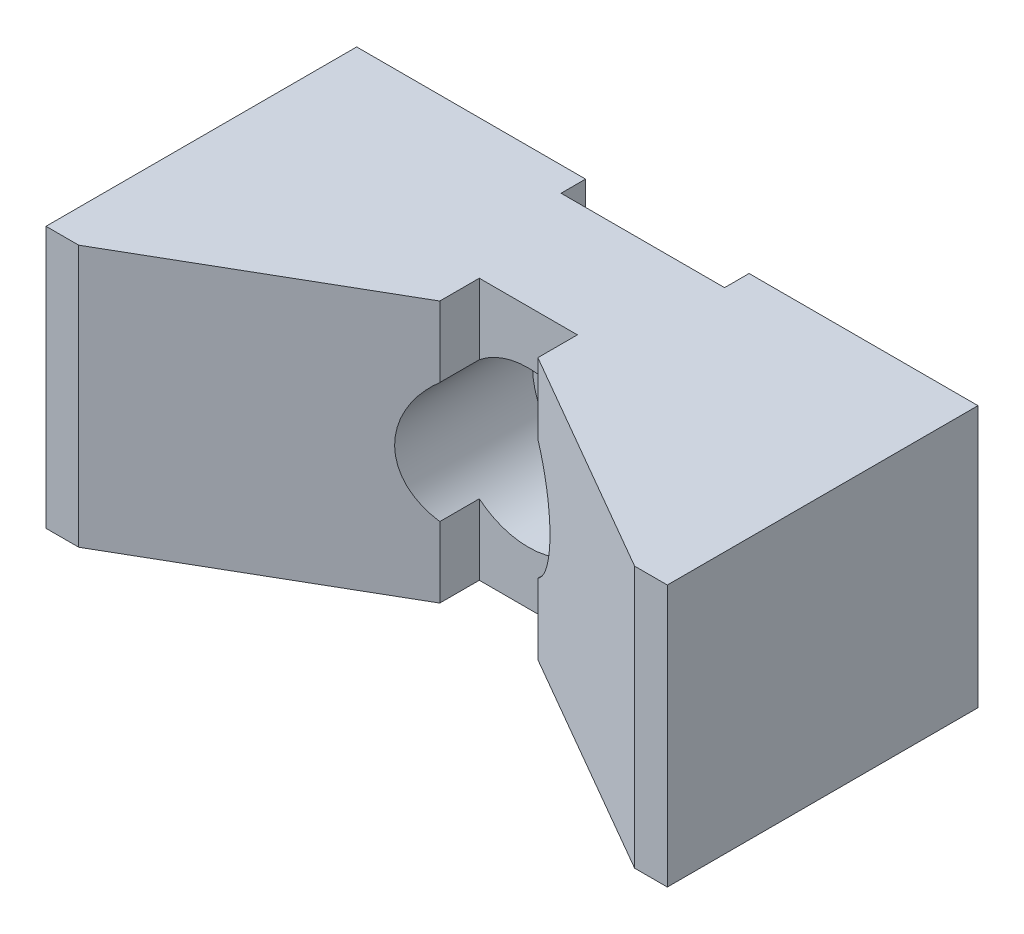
ISO-10303-21;
HEADER;
FILE_DESCRIPTION(('STEP AP214'),'2;1');
FILE_NAME('part.step','',(''),(''),'','','');
FILE_SCHEMA(('AUTOMOTIVE_DESIGN { 1 0 10303 214 1 1 1 1 }'));
ENDSEC;
DATA;
#1=APPLICATION_CONTEXT('core data for automotive mechanical design processes');
#2=APPLICATION_PROTOCOL_DEFINITION('international standard','automotive_design',2000,#1);
#3=PRODUCT_CONTEXT('',#1,'mechanical');
#4=PRODUCT('Part','Part','',(#3));
#5=PRODUCT_RELATED_PRODUCT_CATEGORY('part','',(#4));
#6=PRODUCT_DEFINITION_FORMATION('','',#4);
#7=PRODUCT_DEFINITION_CONTEXT('part definition',#1,'design');
#8=PRODUCT_DEFINITION('design','',#6,#7);
#9=PRODUCT_DEFINITION_SHAPE('','',#8);
#10=(LENGTH_UNIT() NAMED_UNIT(*) SI_UNIT(.MILLI.,.METRE.));
#11=(NAMED_UNIT(*) PLANE_ANGLE_UNIT() SI_UNIT($,.RADIAN.));
#12=(NAMED_UNIT(*) SI_UNIT($,.STERADIAN.) SOLID_ANGLE_UNIT());
#13=UNCERTAINTY_MEASURE_WITH_UNIT(LENGTH_MEASURE(1.E-05),#10,'distance_accuracy_value','');
#14=(GEOMETRIC_REPRESENTATION_CONTEXT(3) GLOBAL_UNCERTAINTY_ASSIGNED_CONTEXT((#13)) GLOBAL_UNIT_ASSIGNED_CONTEXT((#10,
#11,#12)) REPRESENTATION_CONTEXT('',''));
#15=CARTESIAN_POINT('',(0.,0.,0.));
#16=DIRECTION('',(0.,0.,1.));
#17=DIRECTION('',(1.,0.,0.));
#18=AXIS2_PLACEMENT_3D('',#15,#16,#17);
#19=CARTESIAN_POINT('',(19.,8.,0.));
#20=DIRECTION('',(0.,0.,1.));
#21=DIRECTION('',(1.,0.,0.));
#22=AXIS2_PLACEMENT_3D('',#19,#20,#21);
#23=PLANE('',#22);
#24=DIRECTION('',(-1.,0.,0.));
#25=VECTOR('',#24,1.);
#26=CARTESIAN_POINT('',(19.,8.,0.));
#27=LINE('',#26,#25);
#28=CARTESIAN_POINT('',(-5.,8.,0.));
#29=VERTEX_POINT('',#28);
#30=CARTESIAN_POINT('',(-19.,8.,0.));
#31=VERTEX_POINT('',#30);
#32=EDGE_CURVE('E238',#29,#31,#27,.T.);
#33=ORIENTED_EDGE('',*,*,#32,.F.);
#34=DIRECTION('',(0.,1.,0.));
#35=VECTOR('',#34,1.);
#36=CARTESIAN_POINT('',(-5.,-29.5,0.));
#37=LINE('',#36,#35);
#38=CARTESIAN_POINT('',(-5.,-8.,0.));
#39=VERTEX_POINT('',#38);
#40=EDGE_CURVE('E189',#39,#29,#37,.T.);
#41=ORIENTED_EDGE('',*,*,#40,.F.);
#42=DIRECTION('',(-1.,0.,0.));
#43=VECTOR('',#42,1.);
#44=CARTESIAN_POINT('',(19.,-8.,0.));
#45=LINE('',#44,#43);
#46=CARTESIAN_POINT('',(-19.,-8.,0.));
#47=VERTEX_POINT('',#46);
#48=EDGE_CURVE('E222',#39,#47,#45,.T.);
#49=ORIENTED_EDGE('',*,*,#48,.T.);
#50=DIRECTION('',(0.,-1.,0.));
#51=VECTOR('',#50,1.);
#52=CARTESIAN_POINT('',(-19.,8.,0.));
#53=LINE('',#52,#51);
#54=EDGE_CURVE('E242',#31,#47,#53,.T.);
#55=ORIENTED_EDGE('',*,*,#54,.F.);
#56=EDGE_LOOP('',(#33,#41,#49,#55));
#57=FACE_BOUND('',#56,.T.);
#58=ADVANCED_FACE('F14',(#57),#23,.F.);
#59=CARTESIAN_POINT('',(-19.,8.,0.));
#60=DIRECTION('',(1.,0.,0.));
#61=DIRECTION('',(0.,0.,-1.));
#62=AXIS2_PLACEMENT_3D('',#59,#60,#61);
#63=PLANE('',#62);
#64=DIRECTION('',(0.,0.,1.));
#65=VECTOR('',#64,1.);
#66=CARTESIAN_POINT('',(-19.,-8.,0.));
#67=LINE('',#66,#65);
#68=CARTESIAN_POINT('',(-19.,-8.,19.));
#69=VERTEX_POINT('',#68);
#70=EDGE_CURVE('E208',#47,#69,#67,.T.);
#71=ORIENTED_EDGE('',*,*,#70,.T.);
#72=DIRECTION('',(0.,-1.,0.));
#73=VECTOR('',#72,1.);
#74=CARTESIAN_POINT('',(-19.,8.,19.));
#75=LINE('',#74,#73);
#76=CARTESIAN_POINT('',(-19.,8.,19.));
#77=VERTEX_POINT('',#76);
#78=EDGE_CURVE('E257',#77,#69,#75,.T.);
#79=ORIENTED_EDGE('',*,*,#78,.F.);
#80=DIRECTION('',(0.,0.,1.));
#81=VECTOR('',#80,1.);
#82=CARTESIAN_POINT('',(-19.,8.,0.));
#83=LINE('',#82,#81);
#84=EDGE_CURVE('E226',#31,#77,#83,.T.);
#85=ORIENTED_EDGE('',*,*,#84,.F.);
#86=ORIENTED_EDGE('',*,*,#54,.T.);
#87=EDGE_LOOP('',(#71,#79,#85,#86));
#88=FACE_BOUND('',#87,.T.);
#89=ADVANCED_FACE('F16',(#88),#63,.F.);
#90=CARTESIAN_POINT('',(-19.,8.,19.));
#91=DIRECTION('',(0.,0.,-1.));
#92=DIRECTION('',(-1.,0.,0.));
#93=AXIS2_PLACEMENT_3D('',#90,#91,#92);
#94=PLANE('',#93);
#95=DIRECTION('',(1.,0.,0.));
#96=VECTOR('',#95,1.);
#97=CARTESIAN_POINT('',(-19.,-8.,19.));
#98=LINE('',#97,#96);
#99=CARTESIAN_POINT('',(-17.,-8.,19.));
#100=VERTEX_POINT('',#99);
#101=EDGE_CURVE('E211',#69,#100,#98,.T.);
#102=ORIENTED_EDGE('',*,*,#101,.T.);
#103=DIRECTION('',(0.,-1.,0.));
#104=VECTOR('',#103,1.);
#105=CARTESIAN_POINT('',(-17.,8.,19.));
#106=LINE('',#105,#104);
#107=CARTESIAN_POINT('',(-17.,8.,19.));
#108=VERTEX_POINT('',#107);
#109=EDGE_CURVE('E254',#108,#100,#106,.T.);
#110=ORIENTED_EDGE('',*,*,#109,.F.);
#111=DIRECTION('',(1.,0.,0.));
#112=VECTOR('',#111,1.);
#113=CARTESIAN_POINT('',(-19.,8.,19.));
#114=LINE('',#113,#112);
#115=EDGE_CURVE('E229',#77,#108,#114,.T.);
#116=ORIENTED_EDGE('',*,*,#115,.F.);
#117=ORIENTED_EDGE('',*,*,#78,.T.);
#118=EDGE_LOOP('',(#102,#110,#116,#117));
#119=FACE_BOUND('',#118,.T.);
#120=ADVANCED_FACE('F330',(#119),#94,.F.);
#121=CARTESIAN_POINT('',(-17.,8.,19.));
#122=DIRECTION('',(-0.5,0.,-0.86602540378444));
#123=DIRECTION('',(-0.86602540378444,0.,0.5));
#124=AXIS2_PLACEMENT_3D('',#121,#122,#123);
#125=PLANE('',#124);
#126=DIRECTION('',(0.86602540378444,0.,-0.5));
#127=VECTOR('',#126,1.);
#128=CARTESIAN_POINT('',(-17.,-8.,19.));
#129=LINE('',#128,#127);
#130=CARTESIAN_POINT('',(-3.,-8.,10.9170962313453));
#131=VERTEX_POINT('',#130);
#132=EDGE_CURVE('E213',#100,#131,#129,.T.);
#133=ORIENTED_EDGE('',*,*,#132,.T.);
#134=DIRECTION('',(0.,1.,0.));
#135=VECTOR('',#134,1.);
#136=CARTESIAN_POINT('',(-3.,8.,10.9170962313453));
#137=LINE('',#136,#135);
#138=CARTESIAN_POINT('',(-3.,-3.68272996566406,10.9170962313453));
#139=VERTEX_POINT('',#138);
#140=EDGE_CURVE('E165',#131,#139,#137,.T.);
#141=ORIENTED_EDGE('',*,*,#140,.T.);
#142=CARTESIAN_POINT('',(0.,0.,9.18504542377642));
#143=DIRECTION('',(-0.5,0.,-0.86602540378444));
#144=DIRECTION('',(0.86602540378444,0.,-0.5));
#145=AXIS2_PLACEMENT_3D('',#142,#143,#144);
#146=ELLIPSE('',#145,5.48482755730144,4.75);
#147=CARTESIAN_POINT('',(-3.,3.68272996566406,10.9170962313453));
#148=VERTEX_POINT('',#147);
#149=EDGE_CURVE('E185',#139,#148,#146,.T.);
#150=ORIENTED_EDGE('',*,*,#149,.T.);
#151=CARTESIAN_POINT('',(-3.,8.,10.9170962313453));
#152=VERTEX_POINT('',#151);
#153=EDGE_CURVE('E37',#148,#152,#137,.T.);
#154=ORIENTED_EDGE('',*,*,#153,.T.);
#155=DIRECTION('',(0.86602540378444,0.,-0.5));
#156=VECTOR('',#155,1.);
#157=CARTESIAN_POINT('',(-17.,8.,19.));
#158=LINE('',#157,#156);
#159=EDGE_CURVE('E159',#108,#152,#158,.T.);
#160=ORIENTED_EDGE('',*,*,#159,.F.);
#161=ORIENTED_EDGE('',*,*,#109,.T.);
#162=EDGE_LOOP('',(#133,#141,#150,#154,#160,#161));
#163=FACE_BOUND('',#162,.T.);
#164=ADVANCED_FACE('F333',(#163),#125,.F.);
#165=CARTESIAN_POINT('',(17.,8.,19.));
#166=DIRECTION('',(0.5,0.,-0.86602540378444));
#167=DIRECTION('',(-0.86602540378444,0.,-0.5));
#168=AXIS2_PLACEMENT_3D('',#165,#166,#167);
#169=PLANE('',#168);
#170=DIRECTION('',(0.86602540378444,0.,0.5));
#171=VECTOR('',#170,1.);
#172=CARTESIAN_POINT('',(17.,8.,19.));
#173=LINE('',#172,#171);
#174=CARTESIAN_POINT('',(3.,8.,10.9170962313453));
#175=VERTEX_POINT('',#174);
#176=CARTESIAN_POINT('',(17.,8.,19.));
#177=VERTEX_POINT('',#176);
#178=EDGE_CURVE('E232',#175,#177,#173,.T.);
#179=ORIENTED_EDGE('',*,*,#178,.F.);
#180=DIRECTION('',(0.,-1.,0.));
#181=VECTOR('',#180,1.);
#182=CARTESIAN_POINT('',(3.,8.,10.9170962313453));
#183=LINE('',#182,#181);
#184=CARTESIAN_POINT('',(3.,3.68272996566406,10.9170962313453));
#185=VERTEX_POINT('',#184);
#186=EDGE_CURVE('E170',#175,#185,#183,.T.);
#187=ORIENTED_EDGE('',*,*,#186,.T.);
#188=CARTESIAN_POINT('',(0.,0.,9.18504542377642));
#189=DIRECTION('',(0.5,0.,-0.86602540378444));
#190=DIRECTION('',(-0.86602540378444,0.,-0.5));
#191=AXIS2_PLACEMENT_3D('',#188,#189,#190);
#192=ELLIPSE('',#191,5.48482755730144,4.75);
#193=CARTESIAN_POINT('',(3.,-3.68272996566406,10.9170962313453));
#194=VERTEX_POINT('',#193);
#195=EDGE_CURVE('E267',#185,#194,#192,.T.);
#196=ORIENTED_EDGE('',*,*,#195,.T.);
#197=CARTESIAN_POINT('',(3.,-8.,10.9170962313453));
#198=VERTEX_POINT('',#197);
#199=EDGE_CURVE('E173',#194,#198,#183,.T.);
#200=ORIENTED_EDGE('',*,*,#199,.T.);
#201=DIRECTION('',(0.86602540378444,0.,0.5));
#202=VECTOR('',#201,1.);
#203=CARTESIAN_POINT('',(17.,-8.,19.));
#204=LINE('',#203,#202);
#205=CARTESIAN_POINT('',(17.,-8.,19.));
#206=VERTEX_POINT('',#205);
#207=EDGE_CURVE('E216',#198,#206,#204,.T.);
#208=ORIENTED_EDGE('',*,*,#207,.T.);
#209=DIRECTION('',(0.,-1.,0.));
#210=VECTOR('',#209,1.);
#211=CARTESIAN_POINT('',(17.,8.,19.));
#212=LINE('',#211,#210);
#213=EDGE_CURVE('E251',#177,#206,#212,.T.);
#214=ORIENTED_EDGE('',*,*,#213,.F.);
#215=EDGE_LOOP('',(#179,#187,#196,#200,#208,#214));
#216=FACE_BOUND('',#215,.T.);
#217=ADVANCED_FACE('F289',(#216),#169,.F.);
#218=CARTESIAN_POINT('',(19.,8.,19.));
#219=DIRECTION('',(0.,0.,-1.));
#220=DIRECTION('',(-1.,0.,0.));
#221=AXIS2_PLACEMENT_3D('',#218,#219,#220);
#222=PLANE('',#221);
#223=DIRECTION('',(1.,0.,0.));
#224=VECTOR('',#223,1.);
#225=CARTESIAN_POINT('',(19.,-8.,19.));
#226=LINE('',#225,#224);
#227=CARTESIAN_POINT('',(19.,-8.,19.));
#228=VERTEX_POINT('',#227);
#229=EDGE_CURVE('E218',#206,#228,#226,.T.);
#230=ORIENTED_EDGE('',*,*,#229,.T.);
#231=DIRECTION('',(0.,-1.,0.));
#232=VECTOR('',#231,1.);
#233=CARTESIAN_POINT('',(19.,8.,19.));
#234=LINE('',#233,#232);
#235=CARTESIAN_POINT('',(19.,8.,19.));
#236=VERTEX_POINT('',#235);
#237=EDGE_CURVE('E248',#236,#228,#234,.T.);
#238=ORIENTED_EDGE('',*,*,#237,.F.);
#239=DIRECTION('',(1.,0.,0.));
#240=VECTOR('',#239,1.);
#241=CARTESIAN_POINT('',(19.,8.,19.));
#242=LINE('',#241,#240);
#243=EDGE_CURVE('E234',#177,#236,#242,.T.);
#244=ORIENTED_EDGE('',*,*,#243,.F.);
#245=ORIENTED_EDGE('',*,*,#213,.T.);
#246=EDGE_LOOP('',(#230,#238,#244,#245));
#247=FACE_BOUND('',#246,.T.);
#248=ADVANCED_FACE('F296',(#247),#222,.F.);
#249=CARTESIAN_POINT('',(19.,8.,0.));
#250=DIRECTION('',(-1.,0.,0.));
#251=DIRECTION('',(0.,0.,1.));
#252=AXIS2_PLACEMENT_3D('',#249,#250,#251);
#253=PLANE('',#252);
#254=DIRECTION('',(0.,0.,-1.));
#255=VECTOR('',#254,1.);
#256=CARTESIAN_POINT('',(19.,-8.,0.));
#257=LINE('',#256,#255);
#258=CARTESIAN_POINT('',(19.,-8.,0.));
#259=VERTEX_POINT('',#258);
#260=EDGE_CURVE('E220',#228,#259,#257,.T.);
#261=ORIENTED_EDGE('',*,*,#260,.T.);
#262=DIRECTION('',(0.,-1.,0.));
#263=VECTOR('',#262,1.);
#264=CARTESIAN_POINT('',(19.,8.,0.));
#265=LINE('',#264,#263);
#266=CARTESIAN_POINT('',(19.,8.,0.));
#267=VERTEX_POINT('',#266);
#268=EDGE_CURVE('E245',#267,#259,#265,.T.);
#269=ORIENTED_EDGE('',*,*,#268,.F.);
#270=DIRECTION('',(0.,0.,-1.));
#271=VECTOR('',#270,1.);
#272=CARTESIAN_POINT('',(19.,8.,0.));
#273=LINE('',#272,#271);
#274=EDGE_CURVE('E236',#236,#267,#273,.T.);
#275=ORIENTED_EDGE('',*,*,#274,.F.);
#276=ORIENTED_EDGE('',*,*,#237,.T.);
#277=EDGE_LOOP('',(#261,#269,#275,#276));
#278=FACE_BOUND('',#277,.T.);
#279=ADVANCED_FACE('F301',(#278),#253,.F.);
#280=CARTESIAN_POINT('',(5.,-8.,0.));
#281=VERTEX_POINT('',#280);
#282=EDGE_CURVE('E223',#259,#281,#45,.T.);
#283=ORIENTED_EDGE('',*,*,#282,.T.);
#284=DIRECTION('',(0.,1.,0.));
#285=VECTOR('',#284,1.);
#286=CARTESIAN_POINT('',(5.,-29.5,0.));
#287=LINE('',#286,#285);
#288=CARTESIAN_POINT('',(5.,8.,0.));
#289=VERTEX_POINT('',#288);
#290=EDGE_CURVE('E192',#281,#289,#287,.T.);
#291=ORIENTED_EDGE('',*,*,#290,.T.);
#292=EDGE_CURVE('E239',#267,#289,#27,.T.);
#293=ORIENTED_EDGE('',*,*,#292,.F.);
#294=ORIENTED_EDGE('',*,*,#268,.T.);
#295=EDGE_LOOP('',(#283,#291,#293,#294));
#296=FACE_BOUND('',#295,.T.);
#297=ADVANCED_FACE('F305',(#296),#23,.F.);
#298=CARTESIAN_POINT('',(-19.,8.,0.));
#299=DIRECTION('',(0.,-1.,0.));
#300=DIRECTION('',(-1.,0.,0.));
#301=AXIS2_PLACEMENT_3D('',#298,#299,#300);
#302=PLANE('',#301);
#303=DIRECTION('',(-1.,0.,0.));
#304=VECTOR('',#303,1.);
#305=CARTESIAN_POINT('',(-3.,8.,8.5));
#306=LINE('',#305,#304);
#307=CARTESIAN_POINT('',(3.,8.,8.5));
#308=VERTEX_POINT('',#307);
#309=CARTESIAN_POINT('',(-3.,8.,8.5));
#310=VERTEX_POINT('',#309);
#311=EDGE_CURVE('E148',#308,#310,#306,.T.);
#312=ORIENTED_EDGE('',*,*,#311,.F.);
#313=DIRECTION('',(0.,0.,-1.));
#314=VECTOR('',#313,1.);
#315=CARTESIAN_POINT('',(3.,8.,8.5));
#316=LINE('',#315,#314);
#317=EDGE_CURVE('E145',#175,#308,#316,.T.);
#318=ORIENTED_EDGE('',*,*,#317,.F.);
#319=ORIENTED_EDGE('',*,*,#178,.T.);
#320=ORIENTED_EDGE('',*,*,#243,.T.);
#321=ORIENTED_EDGE('',*,*,#274,.T.);
#322=ORIENTED_EDGE('',*,*,#292,.T.);
#323=DIRECTION('',(0.,0.,1.));
#324=VECTOR('',#323,1.);
#325=CARTESIAN_POINT('',(5.,8.,0.));
#326=LINE('',#325,#324);
#327=CARTESIAN_POINT('',(5.,8.,1.5));
#328=VERTEX_POINT('',#327);
#329=EDGE_CURVE('E202',#289,#328,#326,.T.);
#330=ORIENTED_EDGE('',*,*,#329,.T.);
#331=DIRECTION('',(-1.,0.,0.));
#332=VECTOR('',#331,1.);
#333=CARTESIAN_POINT('',(-19.,8.,1.5));
#334=LINE('',#333,#332);
#335=CARTESIAN_POINT('',(-5.,8.,1.5));
#336=VERTEX_POINT('',#335);
#337=EDGE_CURVE('E191',#328,#336,#334,.T.);
#338=ORIENTED_EDGE('',*,*,#337,.T.);
#339=DIRECTION('',(0.,0.,-1.));
#340=VECTOR('',#339,1.);
#341=CARTESIAN_POINT('',(-5.,8.,0.));
#342=LINE('',#341,#340);
#343=EDGE_CURVE('E205',#336,#29,#342,.T.);
#344=ORIENTED_EDGE('',*,*,#343,.T.);
#345=ORIENTED_EDGE('',*,*,#32,.T.);
#346=ORIENTED_EDGE('',*,*,#84,.T.);
#347=ORIENTED_EDGE('',*,*,#115,.T.);
#348=ORIENTED_EDGE('',*,*,#159,.T.);
#349=DIRECTION('',(0.,0.,1.));
#350=VECTOR('',#349,1.);
#351=CARTESIAN_POINT('',(-3.,8.,8.5));
#352=LINE('',#351,#350);
#353=EDGE_CURVE('E141',#310,#152,#352,.T.);
#354=ORIENTED_EDGE('',*,*,#353,.F.);
#355=EDGE_LOOP('',(#312,#318,#319,#320,#321,#322,#330,#338,#344,#345,#346,#347,#348,#354));
#356=FACE_BOUND('',#355,.T.);
#357=ADVANCED_FACE('F157',(#356),#302,.F.);
#358=CARTESIAN_POINT('',(-19.,-8.,0.));
#359=DIRECTION('',(0.,-1.,0.));
#360=DIRECTION('',(-1.,0.,0.));
#361=AXIS2_PLACEMENT_3D('',#358,#359,#360);
#362=PLANE('',#361);
#363=DIRECTION('',(0.,0.,1.));
#364=VECTOR('',#363,1.);
#365=CARTESIAN_POINT('',(3.,-8.,0.));
#366=LINE('',#365,#364);
#367=CARTESIAN_POINT('',(3.,-8.,8.5));
#368=VERTEX_POINT('',#367);
#369=EDGE_CURVE('E174',#368,#198,#366,.T.);
#370=ORIENTED_EDGE('',*,*,#369,.F.);
#371=DIRECTION('',(1.,0.,0.));
#372=VECTOR('',#371,1.);
#373=CARTESIAN_POINT('',(-19.,-8.,8.5));
#374=LINE('',#373,#372);
#375=CARTESIAN_POINT('',(-3.,-8.,8.5));
#376=VERTEX_POINT('',#375);
#377=EDGE_CURVE('E176',#376,#368,#374,.T.);
#378=ORIENTED_EDGE('',*,*,#377,.F.);
#379=DIRECTION('',(0.,0.,-1.));
#380=VECTOR('',#379,1.);
#381=CARTESIAN_POINT('',(-3.,-8.,0.));
#382=LINE('',#381,#380);
#383=EDGE_CURVE('E168',#131,#376,#382,.T.);
#384=ORIENTED_EDGE('',*,*,#383,.F.);
#385=ORIENTED_EDGE('',*,*,#132,.F.);
#386=ORIENTED_EDGE('',*,*,#101,.F.);
#387=ORIENTED_EDGE('',*,*,#70,.F.);
#388=ORIENTED_EDGE('',*,*,#48,.F.);
#389=DIRECTION('',(0.,0.,-1.));
#390=VECTOR('',#389,1.);
#391=CARTESIAN_POINT('',(-5.,-8.,0.));
#392=LINE('',#391,#390);
#393=CARTESIAN_POINT('',(-5.,-8.,1.5));
#394=VERTEX_POINT('',#393);
#395=EDGE_CURVE('E265',#394,#39,#392,.T.);
#396=ORIENTED_EDGE('',*,*,#395,.F.);
#397=DIRECTION('',(-1.,0.,0.));
#398=VECTOR('',#397,1.);
#399=CARTESIAN_POINT('',(-19.,-8.,1.5));
#400=LINE('',#399,#398);
#401=CARTESIAN_POINT('',(5.,-8.,1.5));
#402=VERTEX_POINT('',#401);
#403=EDGE_CURVE('E260',#402,#394,#400,.T.);
#404=ORIENTED_EDGE('',*,*,#403,.F.);
#405=DIRECTION('',(0.,0.,1.));
#406=VECTOR('',#405,1.);
#407=CARTESIAN_POINT('',(5.,-8.,0.));
#408=LINE('',#407,#406);
#409=EDGE_CURVE('E262',#281,#402,#408,.T.);
#410=ORIENTED_EDGE('',*,*,#409,.F.);
#411=ORIENTED_EDGE('',*,*,#282,.F.);
#412=ORIENTED_EDGE('',*,*,#260,.F.);
#413=ORIENTED_EDGE('',*,*,#229,.F.);
#414=ORIENTED_EDGE('',*,*,#207,.F.);
#415=EDGE_LOOP('',(#370,#378,#384,#385,#386,#387,#388,#396,#404,#410,#411,#412,#413,#414));
#416=FACE_BOUND('',#415,.T.);
#417=ADVANCED_FACE('F312',(#416),#362,.T.);
#418=CARTESIAN_POINT('',(-5.,-29.5,0.));
#419=DIRECTION('',(-1.,0.,0.));
#420=DIRECTION('',(0.,0.,1.));
#421=AXIS2_PLACEMENT_3D('',#418,#419,#420);
#422=PLANE('',#421);
#423=DIRECTION('',(0.,1.,0.));
#424=VECTOR('',#423,1.);
#425=CARTESIAN_POINT('',(-5.,-29.5,1.5));
#426=LINE('',#425,#424);
#427=EDGE_CURVE('E188',#394,#336,#426,.T.);
#428=ORIENTED_EDGE('',*,*,#427,.F.);
#429=ORIENTED_EDGE('',*,*,#395,.T.);
#430=ORIENTED_EDGE('',*,*,#40,.T.);
#431=ORIENTED_EDGE('',*,*,#343,.F.);
#432=EDGE_LOOP('',(#428,#429,#430,#431));
#433=FACE_BOUND('',#432,.T.);
#434=ADVANCED_FACE('F319',(#433),#422,.F.);
#435=CARTESIAN_POINT('',(5.,-29.5,0.));
#436=DIRECTION('',(1.,0.,0.));
#437=DIRECTION('',(0.,0.,-1.));
#438=AXIS2_PLACEMENT_3D('',#435,#436,#437);
#439=PLANE('',#438);
#440=ORIENTED_EDGE('',*,*,#290,.F.);
#441=ORIENTED_EDGE('',*,*,#409,.T.);
#442=DIRECTION('',(0.,1.,0.));
#443=VECTOR('',#442,1.);
#444=CARTESIAN_POINT('',(5.,-29.5,1.5));
#445=LINE('',#444,#443);
#446=EDGE_CURVE('E195',#402,#328,#445,.T.);
#447=ORIENTED_EDGE('',*,*,#446,.T.);
#448=ORIENTED_EDGE('',*,*,#329,.F.);
#449=EDGE_LOOP('',(#440,#441,#447,#448));
#450=FACE_BOUND('',#449,.T.);
#451=ADVANCED_FACE('F308',(#450),#439,.F.);
#452=CARTESIAN_POINT('',(-5.,-29.5,1.5));
#453=DIRECTION('',(0.,0.,1.));
#454=DIRECTION('',(1.,0.,0.));
#455=AXIS2_PLACEMENT_3D('',#452,#453,#454);
#456=PLANE('',#455);
#457=CARTESIAN_POINT('',(0.,0.,1.5));
#458=DIRECTION('',(0.,0.,1.));
#459=DIRECTION('',(1.,0.,0.));
#460=AXIS2_PLACEMENT_3D('',#457,#458,#459);
#461=CIRCLE('',#460,2.75);
#462=CARTESIAN_POINT('',(2.75,0.,1.5));
#463=VERTEX_POINT('',#462);
#464=EDGE_CURVE('E179',#463,#463,#461,.T.);
#465=ORIENTED_EDGE('',*,*,#464,.T.);
#466=EDGE_LOOP('',(#465));
#467=FACE_BOUND('',#466,.T.);
#468=ORIENTED_EDGE('',*,*,#446,.F.);
#469=ORIENTED_EDGE('',*,*,#403,.T.);
#470=ORIENTED_EDGE('',*,*,#427,.T.);
#471=ORIENTED_EDGE('',*,*,#337,.F.);
#472=EDGE_LOOP('',(#468,#469,#470,#471));
#473=FACE_BOUND('',#472,.T.);
#474=ADVANCED_FACE('F317',(#467,#473),#456,.F.);
#475=CARTESIAN_POINT('',(0.,0.,19.));
#476=DIRECTION('',(0.,0.,-1.));
#477=DIRECTION('',(-1.,0.,0.));
#478=AXIS2_PLACEMENT_3D('',#475,#476,#477);
#479=CYLINDRICAL_SURFACE('',#478,4.75);
#480=CARTESIAN_POINT('',(0.,0.,3.5));
#481=DIRECTION('',(0.,0.,-1.));
#482=DIRECTION('',(-1.,0.,0.));
#483=AXIS2_PLACEMENT_3D('',#480,#481,#482);
#484=CIRCLE('',#483,4.75);
#485=CARTESIAN_POINT('',(-4.75,0.,3.5));
#486=VERTEX_POINT('',#485);
#487=EDGE_CURVE('E182',#486,#486,#484,.T.);
#488=ORIENTED_EDGE('',*,*,#487,.T.);
#489=EDGE_LOOP('',(#488));
#490=FACE_BOUND('',#489,.T.);
#491=ORIENTED_EDGE('',*,*,#195,.F.);
#492=DIRECTION('',(0.,0.,-1.));
#493=VECTOR('',#492,1.);
#494=CARTESIAN_POINT('',(3.,3.68272996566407,19.));
#495=LINE('',#494,#493);
#496=CARTESIAN_POINT('',(3.,3.68272996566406,8.5));
#497=VERTEX_POINT('',#496);
#498=EDGE_CURVE('E9',#185,#497,#495,.T.);
#499=ORIENTED_EDGE('',*,*,#498,.T.);
#500=CARTESIAN_POINT('',(0.,0.,8.5));
#501=DIRECTION('',(0.,0.,-1.));
#502=DIRECTION('',(-1.,0.,0.));
#503=AXIS2_PLACEMENT_3D('',#500,#501,#502);
#504=CIRCLE('',#503,4.75);
#505=CARTESIAN_POINT('',(-3.,3.68272996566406,8.5));
#506=VERTEX_POINT('',#505);
#507=EDGE_CURVE('E22',#497,#506,#504,.F.);
#508=ORIENTED_EDGE('',*,*,#507,.T.);
#509=DIRECTION('',(0.,0.,-1.));
#510=VECTOR('',#509,1.);
#511=CARTESIAN_POINT('',(-3.,3.68272996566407,19.));
#512=LINE('',#511,#510);
#513=EDGE_CURVE('E142',#506,#148,#512,.F.);
#514=ORIENTED_EDGE('',*,*,#513,.T.);
#515=ORIENTED_EDGE('',*,*,#149,.F.);
#516=DIRECTION('',(0.,0.,-1.));
#517=VECTOR('',#516,1.);
#518=CARTESIAN_POINT('',(-3.,-3.68272996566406,19.));
#519=LINE('',#518,#517);
#520=CARTESIAN_POINT('',(-3.,-3.68272996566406,8.5));
#521=VERTEX_POINT('',#520);
#522=EDGE_CURVE('E270',#139,#521,#519,.T.);
#523=ORIENTED_EDGE('',*,*,#522,.T.);
#524=CARTESIAN_POINT('',(3.,-3.68272996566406,8.5));
#525=VERTEX_POINT('',#524);
#526=EDGE_CURVE('E275',#521,#525,#504,.F.);
#527=ORIENTED_EDGE('',*,*,#526,.T.);
#528=DIRECTION('',(0.,0.,-1.));
#529=VECTOR('',#528,1.);
#530=CARTESIAN_POINT('',(3.,-3.68272996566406,19.));
#531=LINE('',#530,#529);
#532=EDGE_CURVE('E278',#525,#194,#531,.F.);
#533=ORIENTED_EDGE('',*,*,#532,.T.);
#534=EDGE_LOOP('',(#491,#499,#508,#514,#515,#523,#527,#533));
#535=FACE_BOUND('',#534,.T.);
#536=ADVANCED_FACE('F283',(#490,#535),#479,.F.);
#537=CARTESIAN_POINT('',(0.,0.,3.5));
#538=DIRECTION('',(0.,0.,-1.));
#539=DIRECTION('',(-1.,0.,0.));
#540=AXIS2_PLACEMENT_3D('',#537,#538,#539);
#541=PLANE('',#540);
#542=CARTESIAN_POINT('',(0.,0.,3.5));
#543=DIRECTION('',(0.,0.,-1.));
#544=DIRECTION('',(-1.,0.,0.));
#545=AXIS2_PLACEMENT_3D('',#542,#543,#544);
#546=CIRCLE('',#545,2.75);
#547=CARTESIAN_POINT('',(-2.75,0.,3.5));
#548=VERTEX_POINT('',#547);
#549=EDGE_CURVE('E178',#548,#548,#546,.T.);
#550=ORIENTED_EDGE('',*,*,#549,.T.);
#551=EDGE_LOOP('',(#550));
#552=FACE_BOUND('',#551,.T.);
#553=ORIENTED_EDGE('',*,*,#487,.F.);
#554=EDGE_LOOP('',(#553));
#555=FACE_BOUND('',#554,.T.);
#556=ADVANCED_FACE('F353',(#552,#555),#541,.F.);
#557=CARTESIAN_POINT('',(0.,0.,19.));
#558=DIRECTION('',(0.,0.,-1.));
#559=DIRECTION('',(-1.,0.,0.));
#560=AXIS2_PLACEMENT_3D('',#557,#558,#559);
#561=CYLINDRICAL_SURFACE('',#560,2.75);
#562=ORIENTED_EDGE('',*,*,#549,.F.);
#563=EDGE_LOOP('',(#562));
#564=FACE_BOUND('',#563,.T.);
#565=ORIENTED_EDGE('',*,*,#464,.F.);
#566=EDGE_LOOP('',(#565));
#567=FACE_BOUND('',#566,.T.);
#568=ADVANCED_FACE('F344',(#564,#567),#561,.F.);
#569=CARTESIAN_POINT('',(3.,-32.,8.5));
#570=DIRECTION('',(1.,0.,0.));
#571=DIRECTION('',(0.,0.,-1.));
#572=AXIS2_PLACEMENT_3D('',#569,#570,#571);
#573=PLANE('',#572);
#574=ORIENTED_EDGE('',*,*,#369,.T.);
#575=ORIENTED_EDGE('',*,*,#199,.F.);
#576=ORIENTED_EDGE('',*,*,#532,.F.);
#577=DIRECTION('',(0.,1.,0.));
#578=VECTOR('',#577,1.);
#579=CARTESIAN_POINT('',(3.,-32.,8.5));
#580=LINE('',#579,#578);
#581=EDGE_CURVE('E163',#368,#525,#580,.T.);
#582=ORIENTED_EDGE('',*,*,#581,.F.);
#583=EDGE_LOOP('',(#574,#575,#576,#582));
#584=FACE_BOUND('',#583,.T.);
#585=ADVANCED_FACE('F342',(#584),#573,.F.);
#586=CARTESIAN_POINT('',(-3.,-32.,8.5));
#587=DIRECTION('',(-1.,0.,0.));
#588=DIRECTION('',(0.,0.,1.));
#589=AXIS2_PLACEMENT_3D('',#586,#587,#588);
#590=PLANE('',#589);
#591=ORIENTED_EDGE('',*,*,#383,.T.);
#592=DIRECTION('',(0.,1.,0.));
#593=VECTOR('',#592,1.);
#594=CARTESIAN_POINT('',(-3.,-32.,8.5));
#595=LINE('',#594,#593);
#596=EDGE_CURVE('E29',#376,#521,#595,.T.);
#597=ORIENTED_EDGE('',*,*,#596,.T.);
#598=ORIENTED_EDGE('',*,*,#522,.F.);
#599=ORIENTED_EDGE('',*,*,#140,.F.);
#600=EDGE_LOOP('',(#591,#597,#598,#599));
#601=FACE_BOUND('',#600,.T.);
#602=ADVANCED_FACE('F334',(#601),#590,.F.);
#603=CARTESIAN_POINT('',(-3.,-32.,8.5));
#604=DIRECTION('',(0.,0.,-1.));
#605=DIRECTION('',(-1.,0.,0.));
#606=AXIS2_PLACEMENT_3D('',#603,#604,#605);
#607=PLANE('',#606);
#608=ORIENTED_EDGE('',*,*,#377,.T.);
#609=ORIENTED_EDGE('',*,*,#581,.T.);
#610=ORIENTED_EDGE('',*,*,#526,.F.);
#611=ORIENTED_EDGE('',*,*,#596,.F.);
#612=EDGE_LOOP('',(#608,#609,#610,#611));
#613=FACE_BOUND('',#612,.T.);
#614=ADVANCED_FACE('F340',(#613),#607,.F.);
#615=EDGE_CURVE('E151',#497,#308,#580,.T.);
#616=ORIENTED_EDGE('',*,*,#615,.T.);
#617=ORIENTED_EDGE('',*,*,#311,.T.);
#618=EDGE_CURVE('E137',#506,#310,#595,.T.);
#619=ORIENTED_EDGE('',*,*,#618,.F.);
#620=ORIENTED_EDGE('',*,*,#507,.F.);
#621=EDGE_LOOP('',(#616,#617,#619,#620));
#622=FACE_BOUND('',#621,.T.);
#623=ADVANCED_FACE('F149',(#622),#607,.F.);
#624=ORIENTED_EDGE('',*,*,#317,.T.);
#625=ORIENTED_EDGE('',*,*,#615,.F.);
#626=ORIENTED_EDGE('',*,*,#498,.F.);
#627=ORIENTED_EDGE('',*,*,#186,.F.);
#628=EDGE_LOOP('',(#624,#625,#626,#627));
#629=FACE_BOUND('',#628,.T.);
#630=ADVANCED_FACE('F285',(#629),#573,.F.);
#631=ORIENTED_EDGE('',*,*,#513,.F.);
#632=ORIENTED_EDGE('',*,*,#618,.T.);
#633=ORIENTED_EDGE('',*,*,#353,.T.);
#634=ORIENTED_EDGE('',*,*,#153,.F.);
#635=EDGE_LOOP('',(#631,#632,#633,#634));
#636=FACE_BOUND('',#635,.T.);
#637=ADVANCED_FACE('F139',(#636),#590,.F.);
#638=CLOSED_SHELL('',(#58,#89,#120,#164,#217,#248,#279,#297,#357,#417,#434,#451,#474,#536,#556,
#568,#585,#602,#614,#623,#630,#637));
#639=MANIFOLD_SOLID_BREP('B1',#638);
#640=ADVANCED_BREP_SHAPE_REPRESENTATION('',(#18,#639),#14);
#641=SHAPE_DEFINITION_REPRESENTATION(#9,#640);
ENDSEC;
END-ISO-10303-21;
